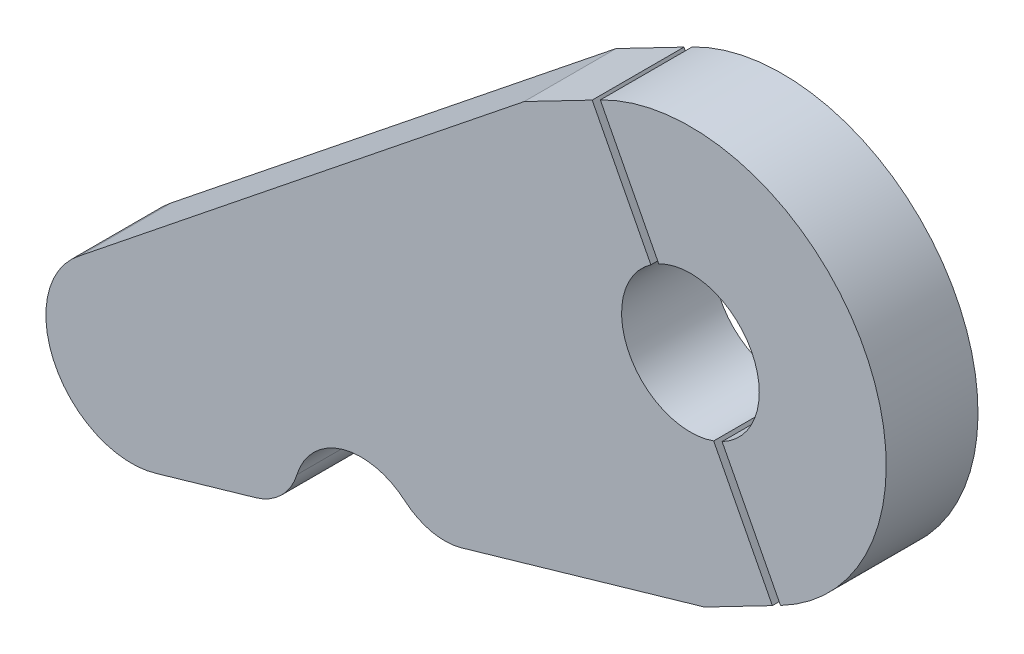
ISO-10303-21;
HEADER;
FILE_DESCRIPTION(('STEP AP214'),'2;1');
FILE_NAME('part.step','',(''),(''),'','','');
FILE_SCHEMA(('AUTOMOTIVE_DESIGN { 1 0 10303 214 1 1 1 1 }'));
ENDSEC;
DATA;
#1=APPLICATION_CONTEXT('core data for automotive mechanical design processes');
#2=APPLICATION_PROTOCOL_DEFINITION('international standard','automotive_design',2000,#1);
#3=PRODUCT_CONTEXT('',#1,'mechanical');
#4=PRODUCT('Part','Part','',(#3));
#5=PRODUCT_RELATED_PRODUCT_CATEGORY('part','',(#4));
#6=PRODUCT_DEFINITION_FORMATION('','',#4);
#7=PRODUCT_DEFINITION_CONTEXT('part definition',#1,'design');
#8=PRODUCT_DEFINITION('design','',#6,#7);
#9=PRODUCT_DEFINITION_SHAPE('','',#8);
#10=(LENGTH_UNIT() NAMED_UNIT(*) SI_UNIT(.MILLI.,.METRE.));
#11=(NAMED_UNIT(*) PLANE_ANGLE_UNIT() SI_UNIT($,.RADIAN.));
#12=(NAMED_UNIT(*) SI_UNIT($,.STERADIAN.) SOLID_ANGLE_UNIT());
#13=UNCERTAINTY_MEASURE_WITH_UNIT(LENGTH_MEASURE(1.E-05),#10,'distance_accuracy_value','');
#14=(GEOMETRIC_REPRESENTATION_CONTEXT(3) GLOBAL_UNCERTAINTY_ASSIGNED_CONTEXT((#13)) GLOBAL_UNIT_ASSIGNED_CONTEXT((#10,
#11,#12)) REPRESENTATION_CONTEXT('',''));
#15=CARTESIAN_POINT('',(0.,0.,0.));
#16=DIRECTION('',(0.,0.,1.));
#17=DIRECTION('',(1.,0.,0.));
#18=AXIS2_PLACEMENT_3D('',#15,#16,#17);
#19=CARTESIAN_POINT('',(119.873360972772,394.98823850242,7.50000000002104));
#20=DIRECTION('',(-0.887843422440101,-0.460145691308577,-1.71551859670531E-12));
#21=DIRECTION('',(0.460145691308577,-0.887843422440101,0.));
#22=AXIS2_PLACEMENT_3D('',#19,#20,#21);
#23=PLANE('',#22);
#24=DIRECTION('',(-0.460145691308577,0.887843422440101,1.31362554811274E-12));
#25=VECTOR('',#24,1.);
#26=CARTESIAN_POINT('',(119.873360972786,394.988238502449,-7.49999999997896));
#27=LINE('',#26,#25);
#28=CARTESIAN_POINT('',(119.873360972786,394.988238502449,-7.49999999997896));
#29=VERTEX_POINT('',#28);
#30=CARTESIAN_POINT('',(110.325337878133,413.410989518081,-7.4999999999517));
#31=VERTEX_POINT('',#30);
#32=EDGE_CURVE('P0_E83',#29,#31,#27,.T.);
#33=ORIENTED_EDGE('',*,*,#32,.F.);
#34=DIRECTION('',(9.18652766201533E-13,1.95568229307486E-12,-1.));
#35=VECTOR('',#34,1.);
#36=CARTESIAN_POINT('',(119.873360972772,394.98823850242,7.50000000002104));
#37=LINE('',#36,#35);
#38=CARTESIAN_POINT('',(119.873360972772,394.98823850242,7.50000000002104));
#39=VERTEX_POINT('',#38);
#40=EDGE_CURVE('P0_E49',#39,#29,#37,.T.);
#41=ORIENTED_EDGE('',*,*,#40,.F.);
#42=DIRECTION('',(-0.460145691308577,0.887843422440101,1.31362554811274E-12));
#43=VECTOR('',#42,1.);
#44=CARTESIAN_POINT('',(119.873360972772,394.98823850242,7.50000000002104));
#45=LINE('',#44,#43);
#46=CARTESIAN_POINT('',(110.325337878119,413.410989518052,7.5000000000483));
#47=VERTEX_POINT('',#46);
#48=EDGE_CURVE('P0_E74',#39,#47,#45,.T.);
#49=ORIENTED_EDGE('',*,*,#48,.T.);
#50=DIRECTION('',(9.18652766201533E-13,1.95568229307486E-12,-1.));
#51=VECTOR('',#50,1.);
#52=CARTESIAN_POINT('',(110.325337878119,413.410989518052,7.5000000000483));
#53=LINE('',#52,#51);
#54=EDGE_CURVE('P0_E11',#47,#31,#53,.T.);
#55=ORIENTED_EDGE('',*,*,#54,.T.);
#56=EDGE_LOOP('',(#33,#41,#49,#55));
#57=FACE_BOUND('',#56,.T.);
#58=ADVANCED_FACE('P0_F16',(#57),#23,.T.);
#59=CARTESIAN_POINT('',(125.049999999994,384.999999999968,7.50000000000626));
#60=DIRECTION('',(9.18652766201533E-13,1.95568229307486E-12,-1.));
#61=DIRECTION('',(0.,1.,1.95568229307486E-12));
#62=AXIS2_PLACEMENT_3D('',#59,#60,#61);
#63=CYLINDRICAL_SURFACE('',#62,32.);
#64=CARTESIAN_POINT('',(125.050000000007,384.999999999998,-7.49999999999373));
#65=DIRECTION('',(9.18652766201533E-13,1.95568229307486E-12,-1.));
#66=DIRECTION('',(0.,-1.,-1.95568229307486E-12));
#67=AXIS2_PLACEMENT_3D('',#64,#65,#66);
#68=CIRCLE('',#67,32.);
#69=CARTESIAN_POINT('',(139.774662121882,356.589010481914,-7.50000000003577));
#70=VERTEX_POINT('',#69);
#71=EDGE_CURVE('P0_E71',#31,#70,#68,.T.);
#72=ORIENTED_EDGE('',*,*,#71,.F.);
#73=ORIENTED_EDGE('',*,*,#54,.F.);
#74=CARTESIAN_POINT('',(125.049999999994,384.999999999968,7.50000000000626));
#75=DIRECTION('',(9.18652766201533E-13,1.95568229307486E-12,-1.));
#76=DIRECTION('',(0.,-1.,-1.95568229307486E-12));
#77=AXIS2_PLACEMENT_3D('',#74,#75,#76);
#78=CIRCLE('',#77,32.);
#79=CARTESIAN_POINT('',(139.774662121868,356.589010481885,7.49999999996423));
#80=VERTEX_POINT('',#79);
#81=EDGE_CURVE('P0_E76',#47,#80,#78,.T.);
#82=ORIENTED_EDGE('',*,*,#81,.T.);
#83=DIRECTION('',(9.18652766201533E-13,1.95568229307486E-12,-1.));
#84=VECTOR('',#83,1.);
#85=CARTESIAN_POINT('',(139.774662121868,356.589010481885,7.49999999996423));
#86=LINE('',#85,#84);
#87=EDGE_CURVE('P0_E20',#80,#70,#86,.T.);
#88=ORIENTED_EDGE('',*,*,#87,.T.);
#89=EDGE_LOOP('',(#72,#73,#82,#88));
#90=FACE_BOUND('',#89,.T.);
#91=ADVANCED_FACE('P0_F90',(#90),#63,.T.);
#92=CARTESIAN_POINT('',(139.774662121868,356.589010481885,7.49999999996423));
#93=DIRECTION('',(-0.887843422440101,-0.460145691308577,-1.71551859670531E-12));
#94=DIRECTION('',(0.460145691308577,-0.887843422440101,0.));
#95=AXIS2_PLACEMENT_3D('',#92,#93,#94);
#96=PLANE('',#95);
#97=DIRECTION('',(-0.460145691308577,0.887843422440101,1.31362554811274E-12));
#98=VECTOR('',#97,1.);
#99=CARTESIAN_POINT('',(139.774662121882,356.589010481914,-7.50000000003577));
#100=LINE('',#99,#98);
#101=CARTESIAN_POINT('',(130.226639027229,375.011761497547,-7.50000000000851));
#102=VERTEX_POINT('',#101);
#103=EDGE_CURVE('P0_E80',#70,#102,#100,.T.);
#104=ORIENTED_EDGE('',*,*,#103,.F.);
#105=ORIENTED_EDGE('',*,*,#87,.F.);
#106=DIRECTION('',(-0.460145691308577,0.887843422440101,1.31362554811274E-12));
#107=VECTOR('',#106,1.);
#108=CARTESIAN_POINT('',(139.774662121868,356.589010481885,7.49999999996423));
#109=LINE('',#108,#107);
#110=CARTESIAN_POINT('',(130.226639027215,375.011761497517,7.49999999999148));
#111=VERTEX_POINT('',#110);
#112=EDGE_CURVE('P0_E69',#80,#111,#109,.T.);
#113=ORIENTED_EDGE('',*,*,#112,.T.);
#114=DIRECTION('',(9.18652766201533E-13,1.95568229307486E-12,-1.));
#115=VECTOR('',#114,1.);
#116=CARTESIAN_POINT('',(130.226639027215,375.011761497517,7.49999999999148));
#117=LINE('',#116,#115);
#118=EDGE_CURVE('P0_E61',#111,#102,#117,.T.);
#119=ORIENTED_EDGE('',*,*,#118,.T.);
#120=EDGE_LOOP('',(#104,#105,#113,#119));
#121=FACE_BOUND('',#120,.T.);
#122=ADVANCED_FACE('P0_F18',(#121),#96,.T.);
#123=CARTESIAN_POINT('',(125.049999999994,384.999999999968,7.50000000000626));
#124=DIRECTION('',(9.18652766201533E-13,1.95568229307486E-12,-1.));
#125=DIRECTION('',(0.,1.,1.95568229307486E-12));
#126=AXIS2_PLACEMENT_3D('',#123,#124,#125);
#127=CYLINDRICAL_SURFACE('',#126,11.25);
#128=CARTESIAN_POINT('',(125.050000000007,384.999999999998,-7.49999999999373));
#129=DIRECTION('',(-9.18652766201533E-13,-1.95568229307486E-12,1.));
#130=DIRECTION('',(0.,-1.,-1.95568229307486E-12));
#131=AXIS2_PLACEMENT_3D('',#128,#129,#130);
#132=CIRCLE('',#131,11.25);
#133=EDGE_CURVE('P0_E66',#102,#29,#132,.T.);
#134=ORIENTED_EDGE('',*,*,#133,.F.);
#135=ORIENTED_EDGE('',*,*,#118,.F.);
#136=CARTESIAN_POINT('',(125.049999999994,384.999999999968,7.50000000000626));
#137=DIRECTION('',(-9.18652766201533E-13,-1.95568229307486E-12,1.));
#138=DIRECTION('',(0.,-1.,-1.95568229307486E-12));
#139=AXIS2_PLACEMENT_3D('',#136,#137,#138);
#140=CIRCLE('',#139,11.25);
#141=EDGE_CURVE('P0_E64',#111,#39,#140,.T.);
#142=ORIENTED_EDGE('',*,*,#141,.T.);
#143=ORIENTED_EDGE('',*,*,#40,.T.);
#144=EDGE_LOOP('',(#134,#135,#142,#143));
#145=FACE_BOUND('',#144,.T.);
#146=ADVANCED_FACE('P0_F62',(#145),#127,.F.);
#147=CARTESIAN_POINT('',(133.687668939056,386.794505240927,7.50000000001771));
#148=DIRECTION('',(9.18645196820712E-13,1.95567250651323E-12,-1.));
#149=DIRECTION('',(0.,1.,1.95567250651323E-12));
#150=AXIS2_PLACEMENT_3D('',#147,#148,#149);
#151=PLANE('',#150);
#152=ORIENTED_EDGE('',*,*,#48,.F.);
#153=ORIENTED_EDGE('',*,*,#141,.F.);
#154=ORIENTED_EDGE('',*,*,#112,.F.);
#155=ORIENTED_EDGE('',*,*,#81,.F.);
#156=EDGE_LOOP('',(#152,#153,#154,#155));
#157=FACE_BOUND('',#156,.T.);
#158=ADVANCED_FACE('P0_F73',(#157),#151,.F.);
#159=CARTESIAN_POINT('',(133.68766893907,386.794505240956,-7.49999999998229));
#160=DIRECTION('',(9.18645196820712E-13,1.95567250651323E-12,-1.));
#161=DIRECTION('',(0.,1.,1.95567250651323E-12));
#162=AXIS2_PLACEMENT_3D('',#159,#160,#161);
#163=PLANE('',#162);
#164=ORIENTED_EDGE('',*,*,#32,.T.);
#165=ORIENTED_EDGE('',*,*,#71,.T.);
#166=ORIENTED_EDGE('',*,*,#103,.T.);
#167=ORIENTED_EDGE('',*,*,#133,.T.);
#168=EDGE_LOOP('',(#164,#165,#166,#167));
#169=FACE_BOUND('',#168,.T.);
#170=ADVANCED_FACE('P0_F89',(#169),#163,.T.);
#171=CLOSED_SHELL('',(#58,#91,#122,#146,#158,#170));
#172=MANIFOLD_SOLID_BREP('P0_B1',#171);
#173=CARTESIAN_POINT('',(134.521030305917,352.220387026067,7.5000000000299));
#174=DIRECTION('',(0.277576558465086,-0.960703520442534,-2.8761053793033E-13));
#175=DIRECTION('',(0.960703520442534,0.277576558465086,0.));
#176=AXIS2_PLACEMENT_3D('',#173,#174,#175);
#177=PLANE('',#176);
#178=DIRECTION('',(-0.960703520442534,-0.277576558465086,-1.05088684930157E-12));
#179=VECTOR('',#178,1.);
#180=CARTESIAN_POINT('',(134.521030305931,352.220387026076,-7.4999999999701));
#181=LINE('',#180,#179);
#182=CARTESIAN_POINT('',(53.9751369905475,328.948220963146,-7.50000000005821));
#183=VERTEX_POINT('',#182);
#184=CARTESIAN_POINT('',(37.8844549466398,324.299131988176,-7.50000000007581));
#185=VERTEX_POINT('',#184);
#186=EDGE_CURVE('P1_E163',#183,#185,#181,.T.);
#187=ORIENTED_EDGE('',*,*,#186,.F.);
#188=DIRECTION('',(9.29756752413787E-13,5.68010011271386E-13,-1.));
#189=VECTOR('',#188,1.);
#190=CARTESIAN_POINT('',(53.9751369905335,328.948220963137,7.49999999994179));
#191=LINE('',#190,#189);
#192=CARTESIAN_POINT('',(53.9751369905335,328.948220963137,7.49999999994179));
#193=VERTEX_POINT('',#192);
#194=EDGE_CURVE('P1_E72',#193,#183,#191,.T.);
#195=ORIENTED_EDGE('',*,*,#194,.F.);
#196=DIRECTION('',(-0.960703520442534,-0.277576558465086,-1.05088684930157E-12));
#197=VECTOR('',#196,1.);
#198=CARTESIAN_POINT('',(134.521030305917,352.220387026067,7.5000000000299));
#199=LINE('',#198,#197);
#200=CARTESIAN_POINT('',(37.8844549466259,324.299131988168,7.49999999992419));
#201=VERTEX_POINT('',#200);
#202=EDGE_CURVE('P1_E129',#193,#201,#199,.T.);
#203=ORIENTED_EDGE('',*,*,#202,.T.);
#204=DIRECTION('',(9.29756752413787E-13,5.68010011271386E-13,-1.));
#205=VECTOR('',#204,1.);
#206=CARTESIAN_POINT('',(37.8844549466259,324.299131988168,7.49999999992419));
#207=LINE('',#206,#205);
#208=EDGE_CURVE('P1_E10',#201,#185,#207,.T.);
#209=ORIENTED_EDGE('',*,*,#208,.T.);
#210=EDGE_LOOP('',(#187,#195,#203,#209));
#211=FACE_BOUND('',#210,.T.);
#212=ADVANCED_FACE('P1_F15',(#211),#177,.T.);
#213=CARTESIAN_POINT('',(33.7167241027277,337.66438618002,7.49999999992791));
#214=DIRECTION('',(9.29756752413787E-13,5.68010011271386E-13,-1.));
#215=DIRECTION('',(-1.,0.,-9.29756752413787E-13));
#216=AXIS2_PLACEMENT_3D('',#213,#214,#215);
#217=CYLINDRICAL_SURFACE('',#216,14.);
#218=CARTESIAN_POINT('',(33.7167241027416,337.664386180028,-7.50000000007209));
#219=DIRECTION('',(9.29756752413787E-13,5.68010011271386E-13,-1.));
#220=DIRECTION('',(1.,0.,9.29756752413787E-13));
#221=AXIS2_PLACEMENT_3D('',#218,#219,#220);
#222=CIRCLE('',#221,14.);
#223=CARTESIAN_POINT('',(25.1991434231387,348.775228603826,-7.5000000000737));
#224=VERTEX_POINT('',#223);
#225=EDGE_CURVE('P1_E166',#185,#224,#222,.T.);
#226=ORIENTED_EDGE('',*,*,#225,.F.);
#227=ORIENTED_EDGE('',*,*,#208,.F.);
#228=CARTESIAN_POINT('',(33.7167241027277,337.66438618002,7.49999999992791));
#229=DIRECTION('',(9.29756752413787E-13,5.68010011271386E-13,-1.));
#230=DIRECTION('',(1.,0.,9.29756752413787E-13));
#231=AXIS2_PLACEMENT_3D('',#228,#229,#230);
#232=CIRCLE('',#231,14.);
#233=CARTESIAN_POINT('',(25.1991434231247,348.775228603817,7.4999999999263));
#234=VERTEX_POINT('',#233);
#235=EDGE_CURVE('P1_E131',#201,#234,#232,.T.);
#236=ORIENTED_EDGE('',*,*,#235,.T.);
#237=DIRECTION('',(9.29756752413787E-13,5.68010011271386E-13,-1.));
#238=VECTOR('',#237,1.);
#239=CARTESIAN_POINT('',(25.1991434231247,348.775228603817,7.4999999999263));
#240=LINE('',#239,#238);
#241=EDGE_CURVE('P1_E19',#234,#224,#240,.T.);
#242=ORIENTED_EDGE('',*,*,#241,.T.);
#243=EDGE_LOOP('',(#226,#227,#236,#242));
#244=FACE_BOUND('',#243,.T.);
#245=ADVANCED_FACE('P1_F185',(#244),#217,.T.);
#246=CARTESIAN_POINT('',(103.726960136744,411.637030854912,7.50000000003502));
#247=DIRECTION('',(-0.624934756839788,0.780676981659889,-1.37604968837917E-13));
#248=DIRECTION('',(-0.780676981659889,-0.624934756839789,0.));
#249=AXIS2_PLACEMENT_3D('',#246,#247,#248);
#250=PLANE('',#249);
#251=DIRECTION('',(0.780676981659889,0.624934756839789,1.08080889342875E-12));
#252=VECTOR('',#251,1.);
#253=CARTESIAN_POINT('',(103.726960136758,411.63703085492,-7.49999999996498));
#254=LINE('',#253,#252);
#255=CARTESIAN_POINT('',(97.8955299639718,406.968949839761,-7.49999999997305));
#256=VERTEX_POINT('',#255);
#257=EDGE_CURVE('P1_E136',#224,#256,#254,.T.);
#258=ORIENTED_EDGE('',*,*,#257,.F.);
#259=ORIENTED_EDGE('',*,*,#241,.F.);
#260=DIRECTION('',(0.780676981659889,0.624934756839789,1.08080889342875E-12));
#261=VECTOR('',#260,1.);
#262=CARTESIAN_POINT('',(103.726960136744,411.637030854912,7.50000000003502));
#263=LINE('',#262,#261);
#264=CARTESIAN_POINT('',(97.8955299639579,406.968949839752,7.50000000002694));
#265=VERTEX_POINT('',#264);
#266=EDGE_CURVE('P1_E168',#234,#265,#263,.T.);
#267=ORIENTED_EDGE('',*,*,#266,.T.);
#268=DIRECTION('',(9.29756752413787E-13,5.68010011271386E-13,-1.));
#269=VECTOR('',#268,1.);
#270=CARTESIAN_POINT('',(97.8955299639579,406.968949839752,7.50000000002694));
#271=LINE('',#270,#269);
#272=EDGE_CURVE('P1_E183',#265,#256,#271,.T.);
#273=ORIENTED_EDGE('',*,*,#272,.T.);
#274=EDGE_LOOP('',(#258,#259,#267,#273));
#275=FACE_BOUND('',#274,.T.);
#276=ADVANCED_FACE('P1_F17',(#275),#250,.T.);
#277=CARTESIAN_POINT('',(110.325337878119,413.410989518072,7.50000000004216));
#278=DIRECTION('',(-0.460145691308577,0.887843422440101,0.));
#279=DIRECTION('',(-0.887843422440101,-0.460145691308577,0.));
#280=AXIS2_PLACEMENT_3D('',#277,#278,#279);
#281=PLANE('',#280);
#282=DIRECTION('',(0.887843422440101,0.460145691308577,1.08684577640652E-12));
#283=VECTOR('',#282,1.);
#284=CARTESIAN_POINT('',(110.325337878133,413.410989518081,-7.49999999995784));
#285=LINE('',#284,#283);
#286=CARTESIAN_POINT('',(108.993572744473,412.720770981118,-7.49999999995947));
#287=VERTEX_POINT('',#286);
#288=EDGE_CURVE('P1_E139',#256,#287,#285,.T.);
#289=ORIENTED_EDGE('',*,*,#288,.F.);
#290=ORIENTED_EDGE('',*,*,#272,.F.);
#291=DIRECTION('',(0.887843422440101,0.460145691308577,1.08684577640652E-12));
#292=VECTOR('',#291,1.);
#293=CARTESIAN_POINT('',(110.325337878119,413.410989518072,7.50000000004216));
#294=LINE('',#293,#292);
#295=CARTESIAN_POINT('',(108.993572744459,412.72077098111,7.50000000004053));
#296=VERTEX_POINT('',#295);
#297=EDGE_CURVE('P1_E259',#265,#296,#294,.T.);
#298=ORIENTED_EDGE('',*,*,#297,.T.);
#299=DIRECTION('',(9.29756752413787E-13,5.68010011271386E-13,-1.));
#300=VECTOR('',#299,1.);
#301=CARTESIAN_POINT('',(108.993572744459,412.72077098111,7.50000000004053));
#302=LINE('',#301,#300);
#303=EDGE_CURVE('P1_E182',#296,#287,#302,.T.);
#304=ORIENTED_EDGE('',*,*,#303,.T.);
#305=EDGE_LOOP('',(#289,#290,#298,#304));
#306=FACE_BOUND('',#305,.T.);
#307=ADVANCED_FACE('P1_F224',(#306),#281,.T.);
#308=CARTESIAN_POINT('',(108.993572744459,412.72077098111,7.50000000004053));
#309=DIRECTION('',(0.887843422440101,0.460145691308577,1.08684577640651E-12));
#310=DIRECTION('',(-0.460145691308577,0.887843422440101,0.));
#311=AXIS2_PLACEMENT_3D('',#308,#309,#310);
#312=PLANE('',#311);
#313=DIRECTION('',(0.460145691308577,-0.887843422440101,0.));
#314=VECTOR('',#313,1.);
#315=CARTESIAN_POINT('',(108.993572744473,412.720770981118,-7.49999999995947));
#316=LINE('',#315,#314);
#317=CARTESIAN_POINT('',(118.587816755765,394.208837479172,-7.49999999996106));
#318=VERTEX_POINT('',#317);
#319=EDGE_CURVE('P1_E142',#287,#318,#316,.T.);
#320=ORIENTED_EDGE('',*,*,#319,.F.);
#321=ORIENTED_EDGE('',*,*,#303,.F.);
#322=DIRECTION('',(0.460145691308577,-0.887843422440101,0.));
#323=VECTOR('',#322,1.);
#324=CARTESIAN_POINT('',(108.993572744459,412.72077098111,7.50000000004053));
#325=LINE('',#324,#323);
#326=CARTESIAN_POINT('',(118.587816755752,394.208837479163,7.50000000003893));
#327=VERTEX_POINT('',#326);
#328=EDGE_CURVE('P1_E236',#296,#327,#325,.T.);
#329=ORIENTED_EDGE('',*,*,#328,.T.);
#330=DIRECTION('',(9.29756752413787E-13,5.68010011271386E-13,-1.));
#331=VECTOR('',#330,1.);
#332=CARTESIAN_POINT('',(118.587816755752,394.208837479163,7.50000000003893));
#333=LINE('',#332,#331);
#334=EDGE_CURVE('P1_E180',#327,#318,#333,.T.);
#335=ORIENTED_EDGE('',*,*,#334,.T.);
#336=EDGE_LOOP('',(#320,#321,#329,#335));
#337=FACE_BOUND('',#336,.T.);
#338=ADVANCED_FACE('P1_F221',(#337),#312,.T.);
#339=CARTESIAN_POINT('',(125.049999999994,384.999999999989,7.50000000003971));
#340=DIRECTION('',(9.29756752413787E-13,5.68010011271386E-13,-1.));
#341=DIRECTION('',(-1.,0.,-9.29756752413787E-13));
#342=AXIS2_PLACEMENT_3D('',#339,#340,#341);
#343=CYLINDRICAL_SURFACE('',#342,11.25);
#344=CARTESIAN_POINT('',(125.050000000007,384.999999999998,-7.49999999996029));
#345=DIRECTION('',(-9.29756752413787E-13,-5.68010011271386E-13,1.));
#346=DIRECTION('',(1.,0.,9.29756752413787E-13));
#347=AXIS2_PLACEMENT_3D('',#344,#345,#346);
#348=CIRCLE('',#347,11.25);
#349=CARTESIAN_POINT('',(128.848652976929,374.410725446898,-7.49999999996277));
#350=VERTEX_POINT('',#349);
#351=EDGE_CURVE('P1_E145',#318,#350,#348,.T.);
#352=ORIENTED_EDGE('',*,*,#351,.F.);
#353=ORIENTED_EDGE('',*,*,#334,.F.);
#354=CARTESIAN_POINT('',(125.049999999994,384.999999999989,7.50000000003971));
#355=DIRECTION('',(-9.29756752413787E-13,-5.68010011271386E-13,1.));
#356=DIRECTION('',(1.,0.,9.29756752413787E-13));
#357=AXIS2_PLACEMENT_3D('',#354,#355,#356);
#358=CIRCLE('',#357,11.25);
#359=CARTESIAN_POINT('',(128.848652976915,374.410725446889,7.50000000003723));
#360=VERTEX_POINT('',#359);
#361=EDGE_CURVE('P1_E240',#327,#360,#358,.T.);
#362=ORIENTED_EDGE('',*,*,#361,.T.);
#363=DIRECTION('',(9.29756752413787E-13,5.68010011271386E-13,-1.));
#364=VECTOR('',#363,1.);
#365=CARTESIAN_POINT('',(128.848652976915,374.410725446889,7.50000000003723));
#366=LINE('',#365,#364);
#367=EDGE_CURVE('P1_E178',#360,#350,#366,.T.);
#368=ORIENTED_EDGE('',*,*,#367,.T.);
#369=EDGE_LOOP('',(#352,#353,#362,#368));
#370=FACE_BOUND('',#369,.T.);
#371=ADVANCED_FACE('P1_F217',(#370),#343,.F.);
#372=CARTESIAN_POINT('',(108.993572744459,412.72077098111,7.50000000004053));
#373=DIRECTION('',(0.887843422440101,0.460145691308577,1.08684577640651E-12));
#374=DIRECTION('',(-0.460145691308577,0.887843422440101,0.));
#375=AXIS2_PLACEMENT_3D('',#372,#373,#374);
#376=PLANE('',#375);
#377=DIRECTION('',(0.460145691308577,-0.887843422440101,0.));
#378=VECTOR('',#377,1.);
#379=CARTESIAN_POINT('',(108.993572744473,412.720770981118,-7.49999999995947));
#380=LINE('',#379,#378);
#381=CARTESIAN_POINT('',(138.442896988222,355.898791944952,-7.49999999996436));
#382=VERTEX_POINT('',#381);
#383=EDGE_CURVE('P1_E148',#350,#382,#380,.T.);
#384=ORIENTED_EDGE('',*,*,#383,.F.);
#385=ORIENTED_EDGE('',*,*,#367,.F.);
#386=DIRECTION('',(0.460145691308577,-0.887843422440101,0.));
#387=VECTOR('',#386,1.);
#388=CARTESIAN_POINT('',(108.993572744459,412.72077098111,7.50000000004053));
#389=LINE('',#388,#387);
#390=CARTESIAN_POINT('',(138.442896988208,355.898791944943,7.50000000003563));
#391=VERTEX_POINT('',#390);
#392=EDGE_CURVE('P1_E255',#360,#391,#389,.T.);
#393=ORIENTED_EDGE('',*,*,#392,.T.);
#394=DIRECTION('',(9.29756752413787E-13,5.68010011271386E-13,-1.));
#395=VECTOR('',#394,1.);
#396=CARTESIAN_POINT('',(138.442896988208,355.898791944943,7.50000000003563));
#397=LINE('',#396,#395);
#398=EDGE_CURVE('P1_E176',#391,#382,#397,.T.);
#399=ORIENTED_EDGE('',*,*,#398,.T.);
#400=EDGE_LOOP('',(#384,#385,#393,#399));
#401=FACE_BOUND('',#400,.T.);
#402=ADVANCED_FACE('P1_F213',(#401),#376,.T.);
#403=CARTESIAN_POINT('',(139.774662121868,356.589010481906,7.50000000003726));
#404=DIRECTION('',(0.460145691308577,-0.887843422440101,0.));
#405=DIRECTION('',(0.887843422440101,0.460145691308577,0.));
#406=AXIS2_PLACEMENT_3D('',#403,#404,#405);
#407=PLANE('',#406);
#408=DIRECTION('',(-0.887843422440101,-0.460145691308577,-1.08684577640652E-12));
#409=VECTOR('',#408,1.);
#410=CARTESIAN_POINT('',(139.774662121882,356.589010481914,-7.49999999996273));
#411=LINE('',#410,#409);
#412=CARTESIAN_POINT('',(127.344854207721,350.146970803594,-7.49999999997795));
#413=VERTEX_POINT('',#412);
#414=EDGE_CURVE('P1_E151',#382,#413,#411,.T.);
#415=ORIENTED_EDGE('',*,*,#414,.F.);
#416=ORIENTED_EDGE('',*,*,#398,.F.);
#417=DIRECTION('',(-0.887843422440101,-0.460145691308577,-1.08684577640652E-12));
#418=VECTOR('',#417,1.);
#419=CARTESIAN_POINT('',(139.774662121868,356.589010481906,7.50000000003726));
#420=LINE('',#419,#418);
#421=CARTESIAN_POINT('',(127.344854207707,350.146970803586,7.50000000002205));
#422=VERTEX_POINT('',#421);
#423=EDGE_CURVE('P1_E247',#391,#422,#420,.T.);
#424=ORIENTED_EDGE('',*,*,#423,.T.);
#425=DIRECTION('',(9.29756752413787E-13,5.68010011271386E-13,-1.));
#426=VECTOR('',#425,1.);
#427=CARTESIAN_POINT('',(127.344854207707,350.146970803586,7.50000000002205));
#428=LINE('',#427,#426);
#429=EDGE_CURVE('P1_E174',#422,#413,#428,.T.);
#430=ORIENTED_EDGE('',*,*,#429,.T.);
#431=EDGE_LOOP('',(#415,#416,#424,#430));
#432=FACE_BOUND('',#431,.T.);
#433=ADVANCED_FACE('P1_F209',(#432),#407,.T.);
#434=CARTESIAN_POINT('',(134.521030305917,352.220387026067,7.5000000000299));
#435=DIRECTION('',(0.277576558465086,-0.960703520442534,-2.8761053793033E-13));
#436=DIRECTION('',(0.960703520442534,0.277576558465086,0.));
#437=AXIS2_PLACEMENT_3D('',#434,#435,#436);
#438=PLANE('',#437);
#439=DIRECTION('',(-0.960703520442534,-0.277576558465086,-1.05088684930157E-12));
#440=VECTOR('',#439,1.);
#441=CARTESIAN_POINT('',(134.521030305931,352.220387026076,-7.4999999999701));
#442=LINE('',#441,#440);
#443=CARTESIAN_POINT('',(87.6716101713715,338.684160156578,-7.50000000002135));
#444=VERTEX_POINT('',#443);
#445=EDGE_CURVE('P1_E154',#413,#444,#442,.T.);
#446=ORIENTED_EDGE('',*,*,#445,.F.);
#447=ORIENTED_EDGE('',*,*,#429,.F.);
#448=DIRECTION('',(-0.960703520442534,-0.277576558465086,-1.05088684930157E-12));
#449=VECTOR('',#448,1.);
#450=CARTESIAN_POINT('',(134.521030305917,352.220387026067,7.5000000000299));
#451=LINE('',#450,#449);
#452=CARTESIAN_POINT('',(87.6716101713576,338.684160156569,7.49999999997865));
#453=VERTEX_POINT('',#452);
#454=EDGE_CURVE('P1_E251',#422,#453,#451,.T.);
#455=ORIENTED_EDGE('',*,*,#454,.T.);
#456=DIRECTION('',(9.29756752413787E-13,5.68010011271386E-13,-1.));
#457=VECTOR('',#456,1.);
#458=CARTESIAN_POINT('',(87.6716101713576,338.684160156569,7.49999999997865));
#459=LINE('',#458,#457);
#460=EDGE_CURVE('P1_E172',#453,#444,#459,.T.);
#461=ORIENTED_EDGE('',*,*,#460,.T.);
#462=EDGE_LOOP('',(#446,#447,#455,#461));
#463=FACE_BOUND('',#462,.T.);
#464=ADVANCED_FACE('P1_F205',(#463),#438,.T.);
#465=CARTESIAN_POINT('',(84.8958445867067,348.291195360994,7.49999999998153));
#466=DIRECTION('',(9.29756752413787E-13,5.68010011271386E-13,-1.));
#467=DIRECTION('',(-1.,0.,-9.29756752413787E-13));
#468=AXIS2_PLACEMENT_3D('',#465,#466,#467);
#469=CYLINDRICAL_SURFACE('',#468,10.);
#470=CARTESIAN_POINT('',(84.8958445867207,348.291195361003,-7.50000000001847));
#471=DIRECTION('',(9.29756752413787E-13,5.68010011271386E-13,-1.));
#472=DIRECTION('',(1.,0.,9.29756752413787E-13));
#473=AXIS2_PLACEMENT_3D('',#470,#471,#472);
#474=CIRCLE('',#473,10.);
#475=CARTESIAN_POINT('',(78.3997592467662,340.688506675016,-7.50000000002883));
#476=VERTEX_POINT('',#475);
#477=EDGE_CURVE('P1_E157',#444,#476,#474,.T.);
#478=ORIENTED_EDGE('',*,*,#477,.F.);
#479=ORIENTED_EDGE('',*,*,#460,.F.);
#480=CARTESIAN_POINT('',(84.8958445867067,348.291195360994,7.49999999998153));
#481=DIRECTION('',(9.29756752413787E-13,5.68010011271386E-13,-1.));
#482=DIRECTION('',(1.,0.,9.29756752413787E-13));
#483=AXIS2_PLACEMENT_3D('',#480,#481,#482);
#484=CIRCLE('',#483,10.);
#485=CARTESIAN_POINT('',(78.3997592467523,340.688506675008,7.49999999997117));
#486=VERTEX_POINT('',#485);
#487=EDGE_CURVE('P1_E126',#453,#486,#484,.T.);
#488=ORIENTED_EDGE('',*,*,#487,.T.);
#489=DIRECTION('',(9.29756752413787E-13,5.68010011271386E-13,-1.));
#490=VECTOR('',#489,1.);
#491=CARTESIAN_POINT('',(78.3997592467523,340.688506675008,7.49999999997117));
#492=LINE('',#491,#490);
#493=EDGE_CURVE('P1_E118',#486,#476,#492,.T.);
#494=ORIENTED_EDGE('',*,*,#493,.T.);
#495=EDGE_LOOP('',(#478,#479,#488,#494));
#496=FACE_BOUND('',#495,.T.);
#497=ADVANCED_FACE('P1_F202',(#496),#469,.T.);
#498=CARTESIAN_POINT('',(71.2540653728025,332.325549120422,7.49999999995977));
#499=DIRECTION('',(9.29756752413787E-13,5.68010011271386E-13,-1.));
#500=DIRECTION('',(-1.,0.,-9.29756752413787E-13));
#501=AXIS2_PLACEMENT_3D('',#498,#499,#500);
#502=CYLINDRICAL_SURFACE('',#501,11.);
#503=CARTESIAN_POINT('',(71.2540653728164,332.325549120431,-7.50000000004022));
#504=DIRECTION('',(-9.29756752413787E-13,-5.68010011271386E-13,1.));
#505=DIRECTION('',(1.,0.,9.29756752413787E-13));
#506=AXIS2_PLACEMENT_3D('',#503,#504,#505);
#507=CIRCLE('',#506,11.);
#508=CARTESIAN_POINT('',(60.7492256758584,335.588729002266,-7.50000000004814));
#509=VERTEX_POINT('',#508);
#510=EDGE_CURVE('P1_E160',#476,#509,#507,.T.);
#511=ORIENTED_EDGE('',*,*,#510,.F.);
#512=ORIENTED_EDGE('',*,*,#493,.F.);
#513=CARTESIAN_POINT('',(71.2540653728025,332.325549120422,7.49999999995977));
#514=DIRECTION('',(-9.29756752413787E-13,-5.68010011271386E-13,1.));
#515=DIRECTION('',(1.,0.,9.29756752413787E-13));
#516=AXIS2_PLACEMENT_3D('',#513,#514,#515);
#517=CIRCLE('',#516,11.);
#518=CARTESIAN_POINT('',(60.7492256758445,335.588729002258,7.49999999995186));
#519=VERTEX_POINT('',#518);
#520=EDGE_CURVE('P1_E121',#486,#519,#517,.T.);
#521=ORIENTED_EDGE('',*,*,#520,.T.);
#522=DIRECTION('',(9.29756752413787E-13,5.68010011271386E-13,-1.));
#523=VECTOR('',#522,1.);
#524=CARTESIAN_POINT('',(60.7492256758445,335.588729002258,7.49999999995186));
#525=LINE('',#524,#523);
#526=EDGE_CURVE('P1_E108',#519,#509,#525,.T.);
#527=ORIENTED_EDGE('',*,*,#526,.T.);
#528=EDGE_LOOP('',(#511,#512,#521,#527));
#529=FACE_BOUND('',#528,.T.);
#530=ADVANCED_FACE('P1_F122',(#529),#502,.F.);
#531=CARTESIAN_POINT('',(51.1993714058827,338.555256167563,7.49999999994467));
#532=DIRECTION('',(9.29756752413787E-13,5.68010011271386E-13,-1.));
#533=DIRECTION('',(-1.,0.,-9.29756752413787E-13));
#534=AXIS2_PLACEMENT_3D('',#531,#532,#533);
#535=CYLINDRICAL_SURFACE('',#534,10.);
#536=CARTESIAN_POINT('',(51.1993714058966,338.555256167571,-7.50000000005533));
#537=DIRECTION('',(9.29756752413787E-13,5.68010011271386E-13,-1.));
#538=DIRECTION('',(1.,0.,9.29756752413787E-13));
#539=AXIS2_PLACEMENT_3D('',#536,#537,#538);
#540=CIRCLE('',#539,10.);
#541=EDGE_CURVE('P1_E114',#509,#183,#540,.T.);
#542=ORIENTED_EDGE('',*,*,#541,.F.);
#543=ORIENTED_EDGE('',*,*,#526,.F.);
#544=CARTESIAN_POINT('',(51.1993714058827,338.555256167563,7.49999999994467));
#545=DIRECTION('',(9.29756752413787E-13,5.68010011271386E-13,-1.));
#546=DIRECTION('',(1.,0.,9.29756752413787E-13));
#547=AXIS2_PLACEMENT_3D('',#544,#545,#546);
#548=CIRCLE('',#547,10.);
#549=EDGE_CURVE('P1_E112',#519,#193,#548,.T.);
#550=ORIENTED_EDGE('',*,*,#549,.T.);
#551=ORIENTED_EDGE('',*,*,#194,.T.);
#552=EDGE_LOOP('',(#542,#543,#550,#551));
#553=FACE_BOUND('',#552,.T.);
#554=ADVANCED_FACE('P1_F110',(#553),#535,.T.);
#555=CARTESIAN_POINT('',(79.0798105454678,368.192578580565,7.49999999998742));
#556=DIRECTION('',(9.29756323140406E-13,5.68009689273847E-13,-1.));
#557=DIRECTION('',(-1.,0.,-9.29756323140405E-13));
#558=AXIS2_PLACEMENT_3D('',#555,#556,#557);
#559=PLANE('',#558);
#560=ORIENTED_EDGE('',*,*,#202,.F.);
#561=ORIENTED_EDGE('',*,*,#549,.F.);
#562=ORIENTED_EDGE('',*,*,#520,.F.);
#563=ORIENTED_EDGE('',*,*,#487,.F.);
#564=ORIENTED_EDGE('',*,*,#454,.F.);
#565=ORIENTED_EDGE('',*,*,#423,.F.);
#566=ORIENTED_EDGE('',*,*,#392,.F.);
#567=ORIENTED_EDGE('',*,*,#361,.F.);
#568=ORIENTED_EDGE('',*,*,#328,.F.);
#569=ORIENTED_EDGE('',*,*,#297,.F.);
#570=ORIENTED_EDGE('',*,*,#266,.F.);
#571=ORIENTED_EDGE('',*,*,#235,.F.);
#572=EDGE_LOOP('',(#560,#561,#562,#563,#564,#565,#566,#567,#568,#569,#570,#571));
#573=FACE_BOUND('',#572,.T.);
#574=ADVANCED_FACE('P1_F128',(#573),#559,.F.);
#575=CARTESIAN_POINT('',(79.0798105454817,368.192578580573,-7.50000000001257));
#576=DIRECTION('',(9.29756323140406E-13,5.68009689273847E-13,-1.));
#577=DIRECTION('',(-1.,0.,-9.29756323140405E-13));
#578=AXIS2_PLACEMENT_3D('',#575,#576,#577);
#579=PLANE('',#578);
#580=ORIENTED_EDGE('',*,*,#186,.T.);
#581=ORIENTED_EDGE('',*,*,#225,.T.);
#582=ORIENTED_EDGE('',*,*,#257,.T.);
#583=ORIENTED_EDGE('',*,*,#288,.T.);
#584=ORIENTED_EDGE('',*,*,#319,.T.);
#585=ORIENTED_EDGE('',*,*,#351,.T.);
#586=ORIENTED_EDGE('',*,*,#383,.T.);
#587=ORIENTED_EDGE('',*,*,#414,.T.);
#588=ORIENTED_EDGE('',*,*,#445,.T.);
#589=ORIENTED_EDGE('',*,*,#477,.T.);
#590=ORIENTED_EDGE('',*,*,#510,.T.);
#591=ORIENTED_EDGE('',*,*,#541,.T.);
#592=EDGE_LOOP('',(#580,#581,#582,#583,#584,#585,#586,#587,#588,#589,#590,#591));
#593=FACE_BOUND('',#592,.T.);
#594=ADVANCED_FACE('P1_F188',(#593),#579,.T.);
#595=CLOSED_SHELL('',(#212,#245,#276,#307,#338,#371,#402,#433,#464,#497,#530,#554,#574,#594));
#596=MANIFOLD_SOLID_BREP('P1_B1',#595);
#597=ADVANCED_BREP_SHAPE_REPRESENTATION('',(#18,#172,#596),#14);
#598=SHAPE_DEFINITION_REPRESENTATION(#9,#597);
ENDSEC;
END-ISO-10303-21;
